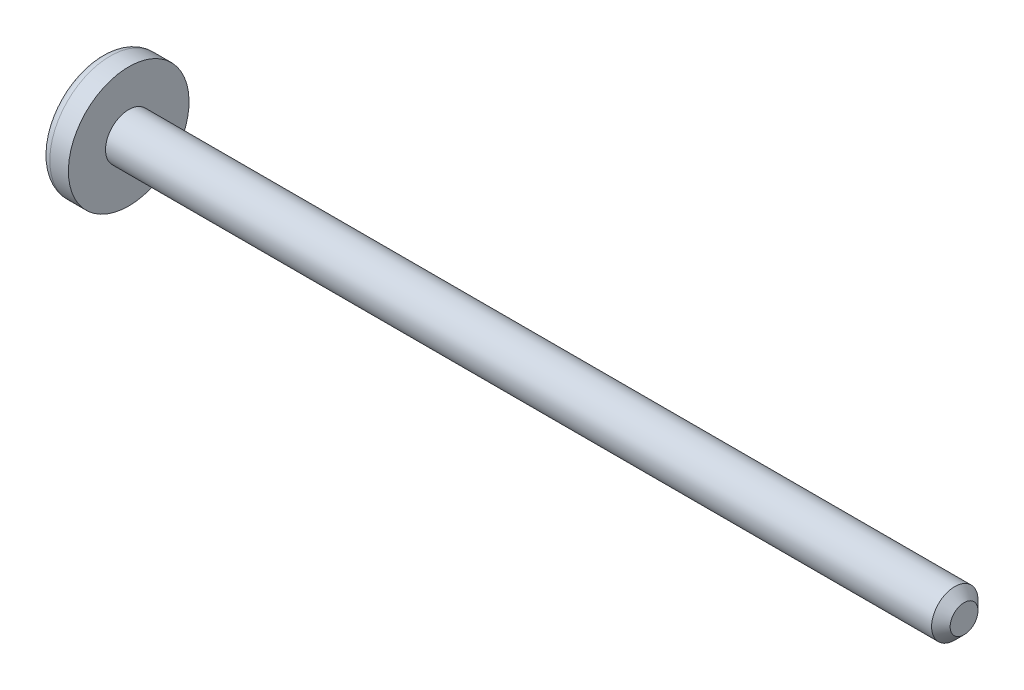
from build123d import *

# Parameters (mm, degrees)
CONG_1_R        = 2
CHANFREIN1_SIZE = 2


with BuildPart() as part:
    # Esquisse1 → R_volution1 (revolve)
    with BuildSketch(Plane(origin=(0, 0, 0), x_dir=(-1, 0, 0), z_dir=(0, 0, -1)), mode=Mode.PRIVATE) as r_volution1_sk:
        Polygon((-186, 5), (-186, 0), (0, 0), (0, 13), (-6, 13), (-6, 5), align=None)
    revolve(r_volution1_sk.sketch.rotate(Axis((186, 0, 0), (-1, 0, 0)), 180), axis=Axis((186, 0, 0), (-1, 0, 0)))

    # Cong_1
    cong_1_edges = [part.edges().sort_by_distance(p)[0] for p in [
        (0, 13, 0),
    ]]
    fillet(cong_1_edges, radius=CONG_1_R)

    # Chanfrein1
    chanfrein1_edges = [part.edges().sort_by_distance(p)[0] for p in [
        (186, 5, 0),
    ]]
    chamfer(chanfrein1_edges, length=CHANFREIN1_SIZE)


solid = part.part
